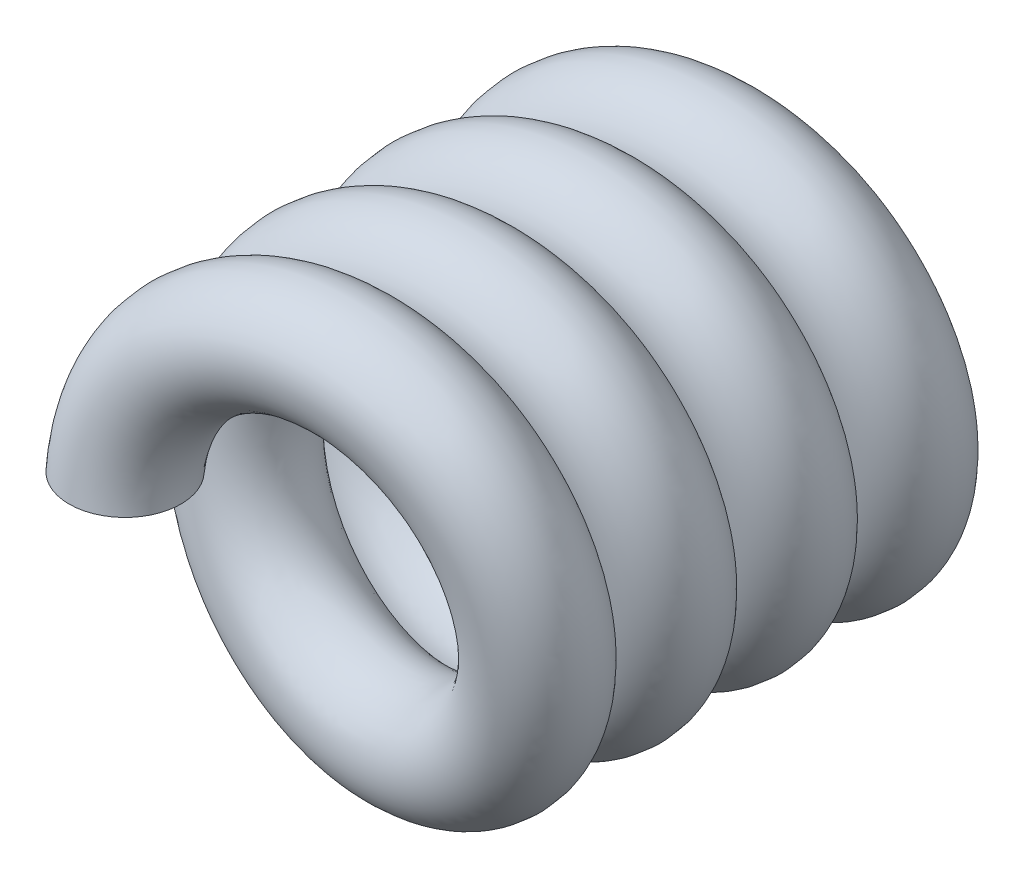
from build123d import *

# Parameters (mm, degrees)
SWEEP1_PITCH       = 1.397
SWEEP1_HEIGHT      = 5.23875
SWEEP1_RADIUS      = 3.175
SWEEP1_START_ANGLE = -90
SKETCH4_R          = 0.6477


with BuildPart() as part:
    # Sweep1: sweep along a helix
    with BuildLine() as sweep1_path:
        add(Helix(SWEEP1_PITCH, SWEEP1_HEIGHT, SWEEP1_RADIUS, center=(0, 0, 0), direction=(0, 0, 1), mode=Mode.PRIVATE).rotate(Axis((0, 0, 0), (0, 0, 1)), SWEEP1_START_ANGLE))
    # Sketch4 → Sweep1 (sweep)
    with BuildSketch(Plane(origin=(0, 0, 0), x_dir=(1, 0, 0), z_dir=(0, 1, 0))):
        with Locations((-2.032, 0)):
            Circle(SKETCH4_R)
    sweep(path=sweep1_path.line, is_frenet=True)


solid = part.part
